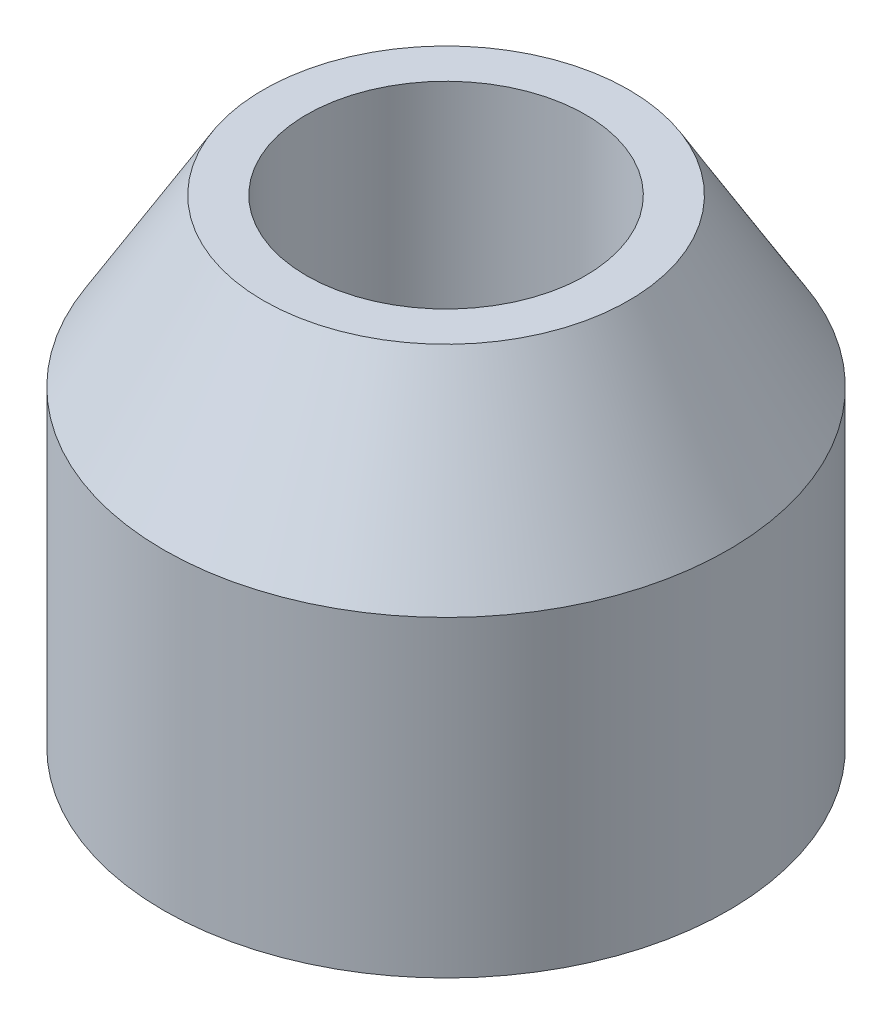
ISO-10303-21;
HEADER;
FILE_DESCRIPTION(('STEP AP214'),'2;1');
FILE_NAME('part.step','',(''),(''),'','','');
FILE_SCHEMA(('AUTOMOTIVE_DESIGN { 1 0 10303 214 1 1 1 1 }'));
ENDSEC;
DATA;
#1=APPLICATION_CONTEXT('core data for automotive mechanical design processes');
#2=APPLICATION_PROTOCOL_DEFINITION('international standard','automotive_design',2000,#1);
#3=PRODUCT_CONTEXT('',#1,'mechanical');
#4=PRODUCT('Part','Part','',(#3));
#5=PRODUCT_RELATED_PRODUCT_CATEGORY('part','',(#4));
#6=PRODUCT_DEFINITION_FORMATION('','',#4);
#7=PRODUCT_DEFINITION_CONTEXT('part definition',#1,'design');
#8=PRODUCT_DEFINITION('design','',#6,#7);
#9=PRODUCT_DEFINITION_SHAPE('','',#8);
#10=(LENGTH_UNIT() NAMED_UNIT(*) SI_UNIT(.MILLI.,.METRE.));
#11=(NAMED_UNIT(*) PLANE_ANGLE_UNIT() SI_UNIT($,.RADIAN.));
#12=(NAMED_UNIT(*) SI_UNIT($,.STERADIAN.) SOLID_ANGLE_UNIT());
#13=UNCERTAINTY_MEASURE_WITH_UNIT(LENGTH_MEASURE(1.E-05),#10,'distance_accuracy_value','');
#14=(GEOMETRIC_REPRESENTATION_CONTEXT(3) GLOBAL_UNCERTAINTY_ASSIGNED_CONTEXT((#13)) GLOBAL_UNIT_ASSIGNED_CONTEXT((#10,
#11,#12)) REPRESENTATION_CONTEXT('',''));
#15=CARTESIAN_POINT('',(0.,0.,0.));
#16=DIRECTION('',(0.,0.,1.));
#17=DIRECTION('',(1.,0.,0.));
#18=AXIS2_PLACEMENT_3D('',#15,#16,#17);
#19=CARTESIAN_POINT('',(0.,7.2,0.));
#20=DIRECTION('',(0.,1.,0.));
#21=DIRECTION('',(0.,0.,1.));
#22=AXIS2_PLACEMENT_3D('',#19,#20,#21);
#23=PLANE('',#22);
#24=CARTESIAN_POINT('',(0.,7.2,0.));
#25=DIRECTION('',(0.,1.,0.));
#26=DIRECTION('',(0.,0.,1.));
#27=AXIS2_PLACEMENT_3D('',#24,#25,#26);
#28=CIRCLE('',#27,2.75);
#29=CARTESIAN_POINT('',(0.,7.2,2.75));
#30=VERTEX_POINT('',#29);
#31=EDGE_CURVE('E49',#30,#30,#28,.T.);
#32=ORIENTED_EDGE('',*,*,#31,.T.);
#33=EDGE_LOOP('',(#32));
#34=FACE_BOUND('',#33,.T.);
#35=CARTESIAN_POINT('',(0.,7.2,0.));
#36=DIRECTION('',(0.,1.,0.));
#37=DIRECTION('',(0.,0.,1.));
#38=AXIS2_PLACEMENT_3D('',#35,#36,#37);
#39=CIRCLE('',#38,2.1);
#40=CARTESIAN_POINT('',(0.,7.2,2.1));
#41=VERTEX_POINT('',#40);
#42=EDGE_CURVE('E57',#41,#41,#39,.T.);
#43=ORIENTED_EDGE('',*,*,#42,.F.);
#44=EDGE_LOOP('',(#43));
#45=FACE_BOUND('',#44,.T.);
#46=ADVANCED_FACE('F41',(#34,#45),#23,.T.);
#47=CARTESIAN_POINT('',(0.,0.,0.));
#48=DIRECTION('',(0.,1.,0.));
#49=DIRECTION('',(0.,0.,1.));
#50=AXIS2_PLACEMENT_3D('',#47,#48,#49);
#51=PLANE('',#50);
#52=CARTESIAN_POINT('',(0.,0.,0.));
#53=DIRECTION('',(0.,1.,0.));
#54=DIRECTION('',(0.,0.,1.));
#55=AXIS2_PLACEMENT_3D('',#52,#53,#54);
#56=CIRCLE('',#55,4.25);
#57=CARTESIAN_POINT('',(0.,0.,4.25));
#58=VERTEX_POINT('',#57);
#59=EDGE_CURVE('E53',#58,#58,#56,.T.);
#60=ORIENTED_EDGE('',*,*,#59,.F.);
#61=EDGE_LOOP('',(#60));
#62=FACE_BOUND('',#61,.T.);
#63=CARTESIAN_POINT('',(0.,0.,0.));
#64=DIRECTION('',(0.,1.,0.));
#65=DIRECTION('',(0.,0.,1.));
#66=AXIS2_PLACEMENT_3D('',#63,#64,#65);
#67=CIRCLE('',#66,2.1);
#68=CARTESIAN_POINT('',(0.,0.,2.1));
#69=VERTEX_POINT('',#68);
#70=EDGE_CURVE('E60',#69,#69,#67,.T.);
#71=ORIENTED_EDGE('',*,*,#70,.T.);
#72=EDGE_LOOP('',(#71));
#73=FACE_BOUND('',#72,.T.);
#74=ADVANCED_FACE('F70',(#62,#73),#51,.F.);
#75=CARTESIAN_POINT('',(0.,7.2,0.));
#76=DIRECTION('',(0.,-1.,0.));
#77=DIRECTION('',(0.,0.,-1.));
#78=AXIS2_PLACEMENT_3D('',#75,#76,#77);
#79=CYLINDRICAL_SURFACE('',#78,4.25);
#80=CARTESIAN_POINT('',(0.,4.69999999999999,0.));
#81=DIRECTION('',(0.,1.,0.));
#82=DIRECTION('',(0.,0.,1.));
#83=AXIS2_PLACEMENT_3D('',#80,#81,#82);
#84=CIRCLE('',#83,4.25);
#85=CARTESIAN_POINT('',(0.,4.69999999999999,4.25));
#86=VERTEX_POINT('',#85);
#87=EDGE_CURVE('E10',#86,#86,#84,.F.);
#88=ORIENTED_EDGE('',*,*,#87,.T.);
#89=EDGE_LOOP('',(#88));
#90=FACE_BOUND('',#89,.T.);
#91=ORIENTED_EDGE('',*,*,#59,.T.);
#92=EDGE_LOOP('',(#91));
#93=FACE_BOUND('',#92,.T.);
#94=ADVANCED_FACE('F77',(#90,#93),#79,.T.);
#95=CARTESIAN_POINT('',(0.,7.2,0.));
#96=DIRECTION('',(0.,-1.,0.));
#97=DIRECTION('',(0.,0.,-1.));
#98=AXIS2_PLACEMENT_3D('',#95,#96,#97);
#99=CYLINDRICAL_SURFACE('',#98,2.1);
#100=ORIENTED_EDGE('',*,*,#42,.T.);
#101=EDGE_LOOP('',(#100));
#102=FACE_BOUND('',#101,.T.);
#103=ORIENTED_EDGE('',*,*,#70,.F.);
#104=EDGE_LOOP('',(#103));
#105=FACE_BOUND('',#104,.T.);
#106=ADVANCED_FACE('F66',(#102,#105),#99,.F.);
#107=CARTESIAN_POINT('',(0.,7.2,0.));
#108=DIRECTION('',(0.,-1.,0.));
#109=DIRECTION('',(0.,0.,-1.));
#110=AXIS2_PLACEMENT_3D('',#107,#108,#109);
#111=CONICAL_SURFACE('',#110,2.75,0.540419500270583);
#112=ORIENTED_EDGE('',*,*,#87,.F.);
#113=EDGE_LOOP('',(#112));
#114=FACE_BOUND('',#113,.T.);
#115=ORIENTED_EDGE('',*,*,#31,.F.);
#116=EDGE_LOOP('',(#115));
#117=FACE_BOUND('',#116,.T.);
#118=ADVANCED_FACE('F44',(#114,#117),#111,.T.);
#119=CLOSED_SHELL('',(#46,#74,#94,#106,#118));
#120=MANIFOLD_SOLID_BREP('B2',#119);
#121=ADVANCED_BREP_SHAPE_REPRESENTATION('',(#18,#120),#14);
#122=SHAPE_DEFINITION_REPRESENTATION(#9,#121);
ENDSEC;
END-ISO-10303-21;
